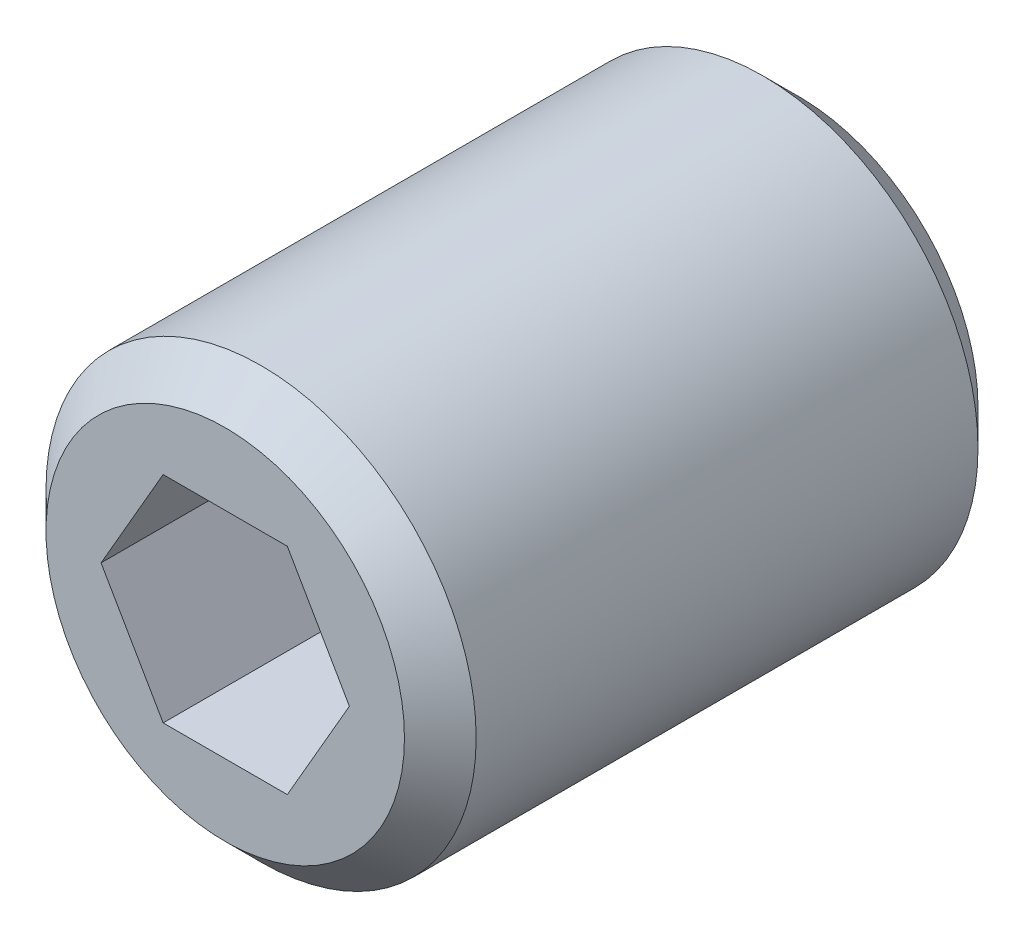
from build123d import *

# Parameters (mm, degrees)
ESQUISSE1_R             = 3
BASE_EXTRUSION_DEPTH    = 8
CHANFREIN1_SIZE         = 0.5
ENL_V_MAT_EXTRU_1_DEPTH = 3.7


with BuildPart() as part:
    # Esquisse1 → Base-Extrusion (new body)
    with BuildSketch(Plane.XY):
        Circle(ESQUISSE1_R)
    extrude(amount=BASE_EXTRUSION_DEPTH)

    # Chanfrein1
    chanfrein1_edges = [part.edges().sort_by_distance(p)[0] for p in [
        (-3, 0, 0),
        (-3, 0, 8),
    ]]
    chamfer(chanfrein1_edges, length=CHANFREIN1_SIZE)

    # Esquisse2 → Enl_v. mat.-Extru.1 (cut)
    with BuildSketch(Plane.XY.offset(8)):
        Polygon((-0.866025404, 1.5), (0.866025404, 1.5), (1.732050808, 0), (0.866025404, -1.5), (-0.866025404, -1.5), (-1.732050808, 0), align=None)
    extrude(amount=-ENL_V_MAT_EXTRU_1_DEPTH, mode=Mode.SUBTRACT)


solid = part.part
